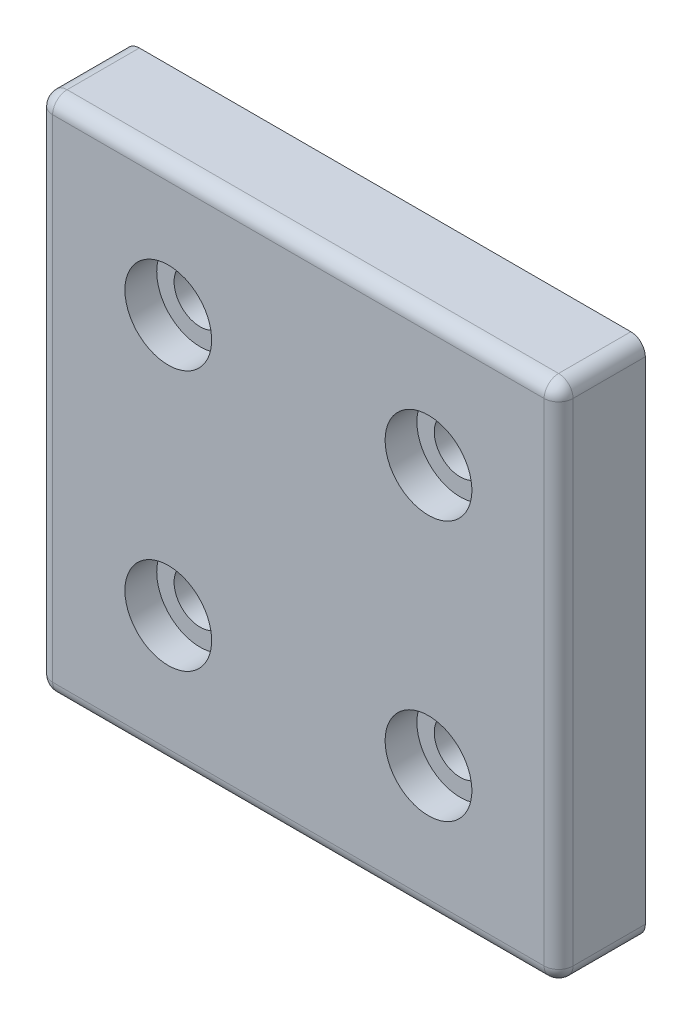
ISO-10303-21;
HEADER;
FILE_DESCRIPTION(('STEP AP214'),'2;1');
FILE_NAME('part.step','',(''),(''),'','','');
FILE_SCHEMA(('AUTOMOTIVE_DESIGN { 1 0 10303 214 1 1 1 1 }'));
ENDSEC;
DATA;
#1=APPLICATION_CONTEXT('core data for automotive mechanical design processes');
#2=APPLICATION_PROTOCOL_DEFINITION('international standard','automotive_design',2000,#1);
#3=PRODUCT_CONTEXT('',#1,'mechanical');
#4=PRODUCT('Part','Part','',(#3));
#5=PRODUCT_RELATED_PRODUCT_CATEGORY('part','',(#4));
#6=PRODUCT_DEFINITION_FORMATION('','',#4);
#7=PRODUCT_DEFINITION_CONTEXT('part definition',#1,'design');
#8=PRODUCT_DEFINITION('design','',#6,#7);
#9=PRODUCT_DEFINITION_SHAPE('','',#8);
#10=(LENGTH_UNIT() NAMED_UNIT(*) SI_UNIT(.MILLI.,.METRE.));
#11=(NAMED_UNIT(*) PLANE_ANGLE_UNIT() SI_UNIT($,.RADIAN.));
#12=(NAMED_UNIT(*) SI_UNIT($,.STERADIAN.) SOLID_ANGLE_UNIT());
#13=UNCERTAINTY_MEASURE_WITH_UNIT(LENGTH_MEASURE(1.E-05),#10,'distance_accuracy_value','');
#14=(GEOMETRIC_REPRESENTATION_CONTEXT(3) GLOBAL_UNCERTAINTY_ASSIGNED_CONTEXT((#13)) GLOBAL_UNIT_ASSIGNED_CONTEXT((#10,
#11,#12)) REPRESENTATION_CONTEXT('',''));
#15=CARTESIAN_POINT('',(0.,0.,0.));
#16=DIRECTION('',(0.,0.,1.));
#17=DIRECTION('',(1.,0.,0.));
#18=AXIS2_PLACEMENT_3D('',#15,#16,#17);
#19=CARTESIAN_POINT('',(0.,0.,15.));
#20=DIRECTION('',(0.,0.,1.));
#21=DIRECTION('',(1.,0.,0.));
#22=AXIS2_PLACEMENT_3D('',#19,#20,#21);
#23=PLANE('',#22);
#24=CARTESIAN_POINT('',(22.5,22.5,15.));
#25=DIRECTION('',(0.,0.,-1.));
#26=DIRECTION('',(-1.,0.,0.));
#27=AXIS2_PLACEMENT_3D('',#24,#25,#26);
#28=CIRCLE('',#27,7.5);
#29=CARTESIAN_POINT('',(15.,22.5,15.));
#30=VERTEX_POINT('',#29);
#31=EDGE_CURVE('E125',#30,#30,#28,.T.);
#32=ORIENTED_EDGE('',*,*,#31,.T.);
#33=EDGE_LOOP('',(#32));
#34=FACE_BOUND('',#33,.T.);
#35=CARTESIAN_POINT('',(-22.5,22.5,15.));
#36=DIRECTION('',(0.,0.,-1.));
#37=DIRECTION('',(-1.,0.,0.));
#38=AXIS2_PLACEMENT_3D('',#35,#36,#37);
#39=CIRCLE('',#38,7.5);
#40=CARTESIAN_POINT('',(-30.,22.5,15.));
#41=VERTEX_POINT('',#40);
#42=EDGE_CURVE('E19',#41,#41,#39,.T.);
#43=ORIENTED_EDGE('',*,*,#42,.T.);
#44=EDGE_LOOP('',(#43));
#45=FACE_BOUND('',#44,.T.);
#46=CARTESIAN_POINT('',(-22.5,-22.5,15.));
#47=DIRECTION('',(0.,0.,-1.));
#48=DIRECTION('',(-1.,0.,0.));
#49=AXIS2_PLACEMENT_3D('',#46,#47,#48);
#50=CIRCLE('',#49,7.5);
#51=CARTESIAN_POINT('',(-30.,-22.5,15.));
#52=VERTEX_POINT('',#51);
#53=EDGE_CURVE('E123',#52,#52,#50,.T.);
#54=ORIENTED_EDGE('',*,*,#53,.T.);
#55=EDGE_LOOP('',(#54));
#56=FACE_BOUND('',#55,.T.);
#57=CARTESIAN_POINT('',(22.5,-22.5,15.));
#58=DIRECTION('',(0.,0.,-1.));
#59=DIRECTION('',(-1.,0.,0.));
#60=AXIS2_PLACEMENT_3D('',#57,#58,#59);
#61=CIRCLE('',#60,7.5);
#62=CARTESIAN_POINT('',(15.,-22.5,15.));
#63=VERTEX_POINT('',#62);
#64=EDGE_CURVE('E119',#63,#63,#61,.T.);
#65=ORIENTED_EDGE('',*,*,#64,.T.);
#66=EDGE_LOOP('',(#65));
#67=FACE_BOUND('',#66,.T.);
#68=DIRECTION('',(-1.,0.,0.));
#69=VECTOR('',#68,1.);
#70=CARTESIAN_POINT('',(22.5,-42.5,15.));
#71=LINE('',#70,#69);
#72=CARTESIAN_POINT('',(42.5,-42.5,15.));
#73=VERTEX_POINT('',#72);
#74=CARTESIAN_POINT('',(-42.5,-42.5,15.));
#75=VERTEX_POINT('',#74);
#76=EDGE_CURVE('E346',#73,#75,#71,.T.);
#77=ORIENTED_EDGE('',*,*,#76,.F.);
#78=DIRECTION('',(0.,-1.,0.));
#79=VECTOR('',#78,1.);
#80=CARTESIAN_POINT('',(42.5,22.5,15.));
#81=LINE('',#80,#79);
#82=CARTESIAN_POINT('',(42.5,42.5,15.));
#83=VERTEX_POINT('',#82);
#84=EDGE_CURVE('E217',#83,#73,#81,.T.);
#85=ORIENTED_EDGE('',*,*,#84,.F.);
#86=DIRECTION('',(1.,0.,0.));
#87=VECTOR('',#86,1.);
#88=CARTESIAN_POINT('',(-22.5,42.5,15.));
#89=LINE('',#88,#87);
#90=CARTESIAN_POINT('',(-42.5,42.5,15.));
#91=VERTEX_POINT('',#90);
#92=EDGE_CURVE('E122',#91,#83,#89,.T.);
#93=ORIENTED_EDGE('',*,*,#92,.F.);
#94=DIRECTION('',(0.,1.,0.));
#95=VECTOR('',#94,1.);
#96=CARTESIAN_POINT('',(-42.5,-22.5,15.));
#97=LINE('',#96,#95);
#98=EDGE_CURVE('E260',#75,#91,#97,.T.);
#99=ORIENTED_EDGE('',*,*,#98,.F.);
#100=EDGE_LOOP('',(#77,#85,#93,#99));
#101=FACE_BOUND('',#100,.T.);
#102=ADVANCED_FACE('F15',(#34,#45,#56,#67,#101),#23,.T.);
#103=CARTESIAN_POINT('',(-22.5,22.5,15.));
#104=DIRECTION('',(0.,0.,-1.));
#105=DIRECTION('',(-1.,0.,0.));
#106=AXIS2_PLACEMENT_3D('',#103,#104,#105);
#107=CYLINDRICAL_SURFACE('',#106,7.5);
#108=CARTESIAN_POINT('',(-22.5,22.5,9.5));
#109=DIRECTION('',(0.,0.,-1.));
#110=DIRECTION('',(-1.,0.,0.));
#111=AXIS2_PLACEMENT_3D('',#108,#109,#110);
#112=CIRCLE('',#111,7.5);
#113=CARTESIAN_POINT('',(-30.,22.5,9.5));
#114=VERTEX_POINT('',#113);
#115=EDGE_CURVE('E115',#114,#114,#112,.T.);
#116=ORIENTED_EDGE('',*,*,#115,.T.);
#117=EDGE_LOOP('',(#116));
#118=FACE_BOUND('',#117,.T.);
#119=ORIENTED_EDGE('',*,*,#42,.F.);
#120=EDGE_LOOP('',(#119));
#121=FACE_BOUND('',#120,.T.);
#122=ADVANCED_FACE('F134',(#118,#121),#107,.F.);
#123=CARTESIAN_POINT('',(22.5,22.5,15.));
#124=DIRECTION('',(0.,0.,-1.));
#125=DIRECTION('',(-1.,0.,0.));
#126=AXIS2_PLACEMENT_3D('',#123,#124,#125);
#127=CYLINDRICAL_SURFACE('',#126,7.5);
#128=CARTESIAN_POINT('',(22.5,22.5,9.5));
#129=DIRECTION('',(0.,0.,-1.));
#130=DIRECTION('',(-1.,0.,0.));
#131=AXIS2_PLACEMENT_3D('',#128,#129,#130);
#132=CIRCLE('',#131,7.5);
#133=CARTESIAN_POINT('',(15.,22.5,9.5));
#134=VERTEX_POINT('',#133);
#135=EDGE_CURVE('E112',#134,#134,#132,.T.);
#136=ORIENTED_EDGE('',*,*,#135,.T.);
#137=EDGE_LOOP('',(#136));
#138=FACE_BOUND('',#137,.T.);
#139=ORIENTED_EDGE('',*,*,#31,.F.);
#140=EDGE_LOOP('',(#139));
#141=FACE_BOUND('',#140,.T.);
#142=ADVANCED_FACE('F136',(#138,#141),#127,.F.);
#143=CARTESIAN_POINT('',(-22.5,-22.5,15.));
#144=DIRECTION('',(0.,0.,-1.));
#145=DIRECTION('',(-1.,0.,0.));
#146=AXIS2_PLACEMENT_3D('',#143,#144,#145);
#147=CYLINDRICAL_SURFACE('',#146,7.5);
#148=CARTESIAN_POINT('',(-22.5,-22.5,9.5));
#149=DIRECTION('',(0.,0.,-1.));
#150=DIRECTION('',(-1.,0.,0.));
#151=AXIS2_PLACEMENT_3D('',#148,#149,#150);
#152=CIRCLE('',#151,7.5);
#153=CARTESIAN_POINT('',(-30.,-22.5,9.5));
#154=VERTEX_POINT('',#153);
#155=EDGE_CURVE('E109',#154,#154,#152,.T.);
#156=ORIENTED_EDGE('',*,*,#155,.T.);
#157=EDGE_LOOP('',(#156));
#158=FACE_BOUND('',#157,.T.);
#159=ORIENTED_EDGE('',*,*,#53,.F.);
#160=EDGE_LOOP('',(#159));
#161=FACE_BOUND('',#160,.T.);
#162=ADVANCED_FACE('F144',(#158,#161),#147,.F.);
#163=CARTESIAN_POINT('',(22.5,-22.5,15.));
#164=DIRECTION('',(0.,0.,-1.));
#165=DIRECTION('',(-1.,0.,0.));
#166=AXIS2_PLACEMENT_3D('',#163,#164,#165);
#167=CYLINDRICAL_SURFACE('',#166,7.5);
#168=CARTESIAN_POINT('',(22.5,-22.5,9.5));
#169=DIRECTION('',(0.,0.,-1.));
#170=DIRECTION('',(-1.,0.,0.));
#171=AXIS2_PLACEMENT_3D('',#168,#169,#170);
#172=CIRCLE('',#171,7.5);
#173=CARTESIAN_POINT('',(15.,-22.5,9.5));
#174=VERTEX_POINT('',#173);
#175=EDGE_CURVE('E105',#174,#174,#172,.T.);
#176=ORIENTED_EDGE('',*,*,#175,.T.);
#177=EDGE_LOOP('',(#176));
#178=FACE_BOUND('',#177,.T.);
#179=ORIENTED_EDGE('',*,*,#64,.F.);
#180=EDGE_LOOP('',(#179));
#181=FACE_BOUND('',#180,.T.);
#182=ADVANCED_FACE('F275',(#178,#181),#167,.F.);
#183=CARTESIAN_POINT('',(-22.5,42.5,12.5));
#184=DIRECTION('',(1.,0.,0.));
#185=DIRECTION('',(0.,1.,0.));
#186=AXIS2_PLACEMENT_3D('',#183,#184,#185);
#187=CYLINDRICAL_SURFACE('',#186,2.5);
#188=CARTESIAN_POINT('',(-42.5,42.5,12.5));
#189=DIRECTION('',(1.,0.,0.));
#190=DIRECTION('',(0.,1.,0.));
#191=AXIS2_PLACEMENT_3D('',#188,#189,#190);
#192=CIRCLE('',#191,2.5);
#193=CARTESIAN_POINT('',(-42.5,45.,12.5));
#194=VERTEX_POINT('',#193);
#195=EDGE_CURVE('E264',#91,#194,#192,.F.);
#196=ORIENTED_EDGE('',*,*,#195,.F.);
#197=ORIENTED_EDGE('',*,*,#92,.T.);
#198=CARTESIAN_POINT('',(42.5,42.5,12.5));
#199=DIRECTION('',(1.,0.,0.));
#200=DIRECTION('',(0.,1.,0.));
#201=AXIS2_PLACEMENT_3D('',#198,#199,#200);
#202=CIRCLE('',#201,2.5);
#203=CARTESIAN_POINT('',(42.5,45.,12.5));
#204=VERTEX_POINT('',#203);
#205=EDGE_CURVE('E214',#204,#83,#202,.T.);
#206=ORIENTED_EDGE('',*,*,#205,.F.);
#207=DIRECTION('',(1.,0.,0.));
#208=VECTOR('',#207,1.);
#209=CARTESIAN_POINT('',(-45.,45.,12.5));
#210=LINE('',#209,#208);
#211=EDGE_CURVE('E108',#194,#204,#210,.T.);
#212=ORIENTED_EDGE('',*,*,#211,.F.);
#213=EDGE_LOOP('',(#196,#197,#206,#212));
#214=FACE_BOUND('',#213,.T.);
#215=ADVANCED_FACE('F272',(#214),#187,.T.);
#216=CARTESIAN_POINT('',(-42.5,42.5,12.5));
#217=DIRECTION('',(1.,0.,0.));
#218=DIRECTION('',(0.,1.,0.));
#219=AXIS2_PLACEMENT_3D('',#216,#217,#218);
#220=SPHERICAL_SURFACE('',#219,2.5);
#221=ORIENTED_EDGE('',*,*,#195,.T.);
#222=CARTESIAN_POINT('',(-42.5,42.5,12.5));
#223=DIRECTION('',(0.,0.,1.));
#224=DIRECTION('',(1.,0.,0.));
#225=AXIS2_PLACEMENT_3D('',#222,#223,#224);
#226=CIRCLE('',#225,2.5);
#227=CARTESIAN_POINT('',(-45.,42.5,12.5));
#228=VERTEX_POINT('',#227);
#229=EDGE_CURVE('E220',#228,#194,#226,.F.);
#230=ORIENTED_EDGE('',*,*,#229,.F.);
#231=CARTESIAN_POINT('',(-42.5,42.5,12.5));
#232=DIRECTION('',(0.,1.,0.));
#233=DIRECTION('',(-1.,0.,0.));
#234=AXIS2_PLACEMENT_3D('',#231,#232,#233);
#235=CIRCLE('',#234,2.5);
#236=EDGE_CURVE('E261',#91,#228,#235,.F.);
#237=ORIENTED_EDGE('',*,*,#236,.F.);
#238=EDGE_LOOP('',(#221,#230,#237));
#239=FACE_BOUND('',#238,.T.);
#240=ADVANCED_FACE('F269',(#239),#220,.T.);
#241=CARTESIAN_POINT('',(-42.5,-22.5,12.5));
#242=DIRECTION('',(0.,1.,0.));
#243=DIRECTION('',(-1.,0.,0.));
#244=AXIS2_PLACEMENT_3D('',#241,#242,#243);
#245=CYLINDRICAL_SURFACE('',#244,2.5);
#246=CARTESIAN_POINT('',(-42.5,-42.5,12.5));
#247=DIRECTION('',(0.,-1.,0.));
#248=DIRECTION('',(1.,0.,0.));
#249=AXIS2_PLACEMENT_3D('',#246,#247,#248);
#250=CIRCLE('',#249,2.5);
#251=CARTESIAN_POINT('',(-45.,-42.5,12.5));
#252=VERTEX_POINT('',#251);
#253=EDGE_CURVE('E256',#75,#252,#250,.T.);
#254=ORIENTED_EDGE('',*,*,#253,.F.);
#255=ORIENTED_EDGE('',*,*,#98,.T.);
#256=ORIENTED_EDGE('',*,*,#236,.T.);
#257=DIRECTION('',(0.,1.,0.));
#258=VECTOR('',#257,1.);
#259=CARTESIAN_POINT('',(-45.,-45.,12.5));
#260=LINE('',#259,#258);
#261=EDGE_CURVE('E74',#252,#228,#260,.T.);
#262=ORIENTED_EDGE('',*,*,#261,.F.);
#263=EDGE_LOOP('',(#254,#255,#256,#262));
#264=FACE_BOUND('',#263,.T.);
#265=ADVANCED_FACE('F249',(#264),#245,.T.);
#266=CARTESIAN_POINT('',(-42.5,-42.5,12.5));
#267=DIRECTION('',(1.,0.,0.));
#268=DIRECTION('',(0.,1.,0.));
#269=AXIS2_PLACEMENT_3D('',#266,#267,#268);
#270=SPHERICAL_SURFACE('',#269,2.5);
#271=ORIENTED_EDGE('',*,*,#253,.T.);
#272=CARTESIAN_POINT('',(-42.5,-42.5,12.5));
#273=DIRECTION('',(0.,0.,1.));
#274=DIRECTION('',(1.,0.,0.));
#275=AXIS2_PLACEMENT_3D('',#272,#273,#274);
#276=CIRCLE('',#275,2.5);
#277=CARTESIAN_POINT('',(-42.5,-45.,12.5));
#278=VERTEX_POINT('',#277);
#279=EDGE_CURVE('E341',#278,#252,#276,.F.);
#280=ORIENTED_EDGE('',*,*,#279,.F.);
#281=CARTESIAN_POINT('',(-42.5,-42.5,12.5));
#282=DIRECTION('',(-1.,0.,0.));
#283=DIRECTION('',(0.,-1.,0.));
#284=AXIS2_PLACEMENT_3D('',#281,#282,#283);
#285=CIRCLE('',#284,2.5);
#286=EDGE_CURVE('E259',#75,#278,#285,.F.);
#287=ORIENTED_EDGE('',*,*,#286,.F.);
#288=EDGE_LOOP('',(#271,#280,#287));
#289=FACE_BOUND('',#288,.T.);
#290=ADVANCED_FACE('F244',(#289),#270,.T.);
#291=CARTESIAN_POINT('',(22.5,-42.5,12.5));
#292=DIRECTION('',(-1.,0.,0.));
#293=DIRECTION('',(0.,-1.,0.));
#294=AXIS2_PLACEMENT_3D('',#291,#292,#293);
#295=CYLINDRICAL_SURFACE('',#294,2.5);
#296=CARTESIAN_POINT('',(42.5,-42.5,12.5));
#297=DIRECTION('',(1.,0.,0.));
#298=DIRECTION('',(0.,1.,0.));
#299=AXIS2_PLACEMENT_3D('',#296,#297,#298);
#300=CIRCLE('',#299,2.5);
#301=CARTESIAN_POINT('',(42.5,-45.,12.5));
#302=VERTEX_POINT('',#301);
#303=EDGE_CURVE('E229',#73,#302,#300,.T.);
#304=ORIENTED_EDGE('',*,*,#303,.F.);
#305=ORIENTED_EDGE('',*,*,#76,.T.);
#306=ORIENTED_EDGE('',*,*,#286,.T.);
#307=DIRECTION('',(1.,0.,0.));
#308=VECTOR('',#307,1.);
#309=CARTESIAN_POINT('',(45.,-45.,12.5));
#310=LINE('',#309,#308);
#311=EDGE_CURVE('E230',#302,#278,#310,.F.);
#312=ORIENTED_EDGE('',*,*,#311,.F.);
#313=EDGE_LOOP('',(#304,#305,#306,#312));
#314=FACE_BOUND('',#313,.T.);
#315=ADVANCED_FACE('F240',(#314),#295,.T.);
#316=CARTESIAN_POINT('',(42.5,-42.5,12.5));
#317=DIRECTION('',(1.,0.,0.));
#318=DIRECTION('',(0.,1.,0.));
#319=AXIS2_PLACEMENT_3D('',#316,#317,#318);
#320=SPHERICAL_SURFACE('',#319,2.5);
#321=CARTESIAN_POINT('',(42.5,-42.5,12.5));
#322=DIRECTION('',(0.,-1.,0.));
#323=DIRECTION('',(0.,0.,-1.));
#324=AXIS2_PLACEMENT_3D('',#321,#322,#323);
#325=CIRCLE('',#324,2.5);
#326=CARTESIAN_POINT('',(45.,-42.5,12.5));
#327=VERTEX_POINT('',#326);
#328=EDGE_CURVE('E226',#73,#327,#325,.F.);
#329=ORIENTED_EDGE('',*,*,#328,.F.);
#330=ORIENTED_EDGE('',*,*,#303,.T.);
#331=CARTESIAN_POINT('',(42.5,-42.5,12.5));
#332=DIRECTION('',(0.,0.,1.));
#333=DIRECTION('',(1.,0.,0.));
#334=AXIS2_PLACEMENT_3D('',#331,#332,#333);
#335=CIRCLE('',#334,2.5);
#336=EDGE_CURVE('E221',#327,#302,#335,.F.);
#337=ORIENTED_EDGE('',*,*,#336,.F.);
#338=EDGE_LOOP('',(#329,#330,#337));
#339=FACE_BOUND('',#338,.T.);
#340=ADVANCED_FACE('F237',(#339),#320,.T.);
#341=CARTESIAN_POINT('',(42.5,22.5,12.5));
#342=DIRECTION('',(0.,-1.,0.));
#343=DIRECTION('',(0.,0.,-1.));
#344=AXIS2_PLACEMENT_3D('',#341,#342,#343);
#345=CYLINDRICAL_SURFACE('',#344,2.5);
#346=CARTESIAN_POINT('',(42.5,42.5,12.5));
#347=DIRECTION('',(0.,-1.,0.));
#348=DIRECTION('',(1.,0.,0.));
#349=AXIS2_PLACEMENT_3D('',#346,#347,#348);
#350=CIRCLE('',#349,2.5);
#351=CARTESIAN_POINT('',(45.,42.5,12.5));
#352=VERTEX_POINT('',#351);
#353=EDGE_CURVE('E118',#83,#352,#350,.F.);
#354=ORIENTED_EDGE('',*,*,#353,.F.);
#355=ORIENTED_EDGE('',*,*,#84,.T.);
#356=ORIENTED_EDGE('',*,*,#328,.T.);
#357=DIRECTION('',(0.,1.,0.));
#358=VECTOR('',#357,1.);
#359=CARTESIAN_POINT('',(45.,45.,12.5));
#360=LINE('',#359,#358);
#361=EDGE_CURVE('E329',#352,#327,#360,.F.);
#362=ORIENTED_EDGE('',*,*,#361,.F.);
#363=EDGE_LOOP('',(#354,#355,#356,#362));
#364=FACE_BOUND('',#363,.T.);
#365=ADVANCED_FACE('F204',(#364),#345,.T.);
#366=CARTESIAN_POINT('',(42.5,42.5,12.5));
#367=DIRECTION('',(1.,0.,0.));
#368=DIRECTION('',(0.,1.,0.));
#369=AXIS2_PLACEMENT_3D('',#366,#367,#368);
#370=SPHERICAL_SURFACE('',#369,2.5);
#371=ORIENTED_EDGE('',*,*,#205,.T.);
#372=ORIENTED_EDGE('',*,*,#353,.T.);
#373=CARTESIAN_POINT('',(42.5,42.5,12.5));
#374=DIRECTION('',(0.,0.,1.));
#375=DIRECTION('',(1.,0.,0.));
#376=AXIS2_PLACEMENT_3D('',#373,#374,#375);
#377=CIRCLE('',#376,2.5);
#378=EDGE_CURVE('E210',#204,#352,#377,.F.);
#379=ORIENTED_EDGE('',*,*,#378,.F.);
#380=EDGE_LOOP('',(#371,#372,#379));
#381=FACE_BOUND('',#380,.T.);
#382=ADVANCED_FACE('F199',(#381),#370,.T.);
#383=CARTESIAN_POINT('',(-30.15,30.15,9.5));
#384=DIRECTION('',(0.,0.,-1.));
#385=DIRECTION('',(1.,0.,0.));
#386=AXIS2_PLACEMENT_3D('',#383,#384,#385);
#387=PLANE('',#386);
#388=CARTESIAN_POINT('',(-22.5,22.5,9.5));
#389=DIRECTION('',(0.,0.,1.));
#390=DIRECTION('',(1.,0.,0.));
#391=AXIS2_PLACEMENT_3D('',#388,#389,#390);
#392=CIRCLE('',#391,4.5);
#393=CARTESIAN_POINT('',(-18.,22.5,9.5));
#394=VERTEX_POINT('',#393);
#395=EDGE_CURVE('E102',#394,#394,#392,.F.);
#396=ORIENTED_EDGE('',*,*,#395,.T.);
#397=EDGE_LOOP('',(#396));
#398=FACE_BOUND('',#397,.T.);
#399=ORIENTED_EDGE('',*,*,#115,.F.);
#400=EDGE_LOOP('',(#399));
#401=FACE_BOUND('',#400,.T.);
#402=ADVANCED_FACE('F203',(#398,#401),#387,.F.);
#403=CARTESIAN_POINT('',(14.85,30.15,9.5));
#404=DIRECTION('',(0.,0.,-1.));
#405=DIRECTION('',(1.,0.,0.));
#406=AXIS2_PLACEMENT_3D('',#403,#404,#405);
#407=PLANE('',#406);
#408=CARTESIAN_POINT('',(22.5,22.5,9.5));
#409=DIRECTION('',(0.,0.,1.));
#410=DIRECTION('',(1.,0.,0.));
#411=AXIS2_PLACEMENT_3D('',#408,#409,#410);
#412=CIRCLE('',#411,4.5);
#413=CARTESIAN_POINT('',(27.,22.5,9.5));
#414=VERTEX_POINT('',#413);
#415=EDGE_CURVE('E99',#414,#414,#412,.F.);
#416=ORIENTED_EDGE('',*,*,#415,.T.);
#417=EDGE_LOOP('',(#416));
#418=FACE_BOUND('',#417,.T.);
#419=ORIENTED_EDGE('',*,*,#135,.F.);
#420=EDGE_LOOP('',(#419));
#421=FACE_BOUND('',#420,.T.);
#422=ADVANCED_FACE('F378',(#418,#421),#407,.F.);
#423=CARTESIAN_POINT('',(-30.15,-14.85,9.5));
#424=DIRECTION('',(0.,0.,-1.));
#425=DIRECTION('',(1.,0.,0.));
#426=AXIS2_PLACEMENT_3D('',#423,#424,#425);
#427=PLANE('',#426);
#428=CARTESIAN_POINT('',(-22.5,-22.5,9.5));
#429=DIRECTION('',(0.,0.,1.));
#430=DIRECTION('',(1.,0.,0.));
#431=AXIS2_PLACEMENT_3D('',#428,#429,#430);
#432=CIRCLE('',#431,4.5);
#433=CARTESIAN_POINT('',(-18.,-22.5,9.5));
#434=VERTEX_POINT('',#433);
#435=EDGE_CURVE('E96',#434,#434,#432,.F.);
#436=ORIENTED_EDGE('',*,*,#435,.T.);
#437=EDGE_LOOP('',(#436));
#438=FACE_BOUND('',#437,.T.);
#439=ORIENTED_EDGE('',*,*,#155,.F.);
#440=EDGE_LOOP('',(#439));
#441=FACE_BOUND('',#440,.T.);
#442=ADVANCED_FACE('F384',(#438,#441),#427,.F.);
#443=CARTESIAN_POINT('',(14.85,-14.85,9.5));
#444=DIRECTION('',(0.,0.,-1.));
#445=DIRECTION('',(1.,0.,0.));
#446=AXIS2_PLACEMENT_3D('',#443,#444,#445);
#447=PLANE('',#446);
#448=CARTESIAN_POINT('',(22.5,-22.5,9.5));
#449=DIRECTION('',(0.,0.,1.));
#450=DIRECTION('',(1.,0.,0.));
#451=AXIS2_PLACEMENT_3D('',#448,#449,#450);
#452=CIRCLE('',#451,4.5);
#453=CARTESIAN_POINT('',(27.,-22.5,9.5));
#454=VERTEX_POINT('',#453);
#455=EDGE_CURVE('E89',#454,#454,#452,.F.);
#456=ORIENTED_EDGE('',*,*,#455,.T.);
#457=EDGE_LOOP('',(#456));
#458=FACE_BOUND('',#457,.T.);
#459=ORIENTED_EDGE('',*,*,#175,.F.);
#460=EDGE_LOOP('',(#459));
#461=FACE_BOUND('',#460,.T.);
#462=ADVANCED_FACE('F17',(#458,#461),#447,.F.);
#463=CARTESIAN_POINT('',(-45.,45.,0.));
#464=DIRECTION('',(0.,1.,0.));
#465=DIRECTION('',(0.,0.,1.));
#466=AXIS2_PLACEMENT_3D('',#463,#464,#465);
#467=PLANE('',#466);
#468=DIRECTION('',(0.,0.,1.));
#469=VECTOR('',#468,1.);
#470=CARTESIAN_POINT('',(-42.5,45.,0.));
#471=LINE('',#470,#469);
#472=CARTESIAN_POINT('',(-42.5,45.,0.));
#473=VERTEX_POINT('',#472);
#474=EDGE_CURVE('E60',#194,#473,#471,.F.);
#475=ORIENTED_EDGE('',*,*,#474,.F.);
#476=ORIENTED_EDGE('',*,*,#211,.T.);
#477=DIRECTION('',(0.,0.,1.));
#478=VECTOR('',#477,1.);
#479=CARTESIAN_POINT('',(42.5,45.,0.));
#480=LINE('',#479,#478);
#481=CARTESIAN_POINT('',(42.5,45.,0.));
#482=VERTEX_POINT('',#481);
#483=EDGE_CURVE('E327',#482,#204,#480,.T.);
#484=ORIENTED_EDGE('',*,*,#483,.F.);
#485=DIRECTION('',(1.,0.,0.));
#486=VECTOR('',#485,1.);
#487=CARTESIAN_POINT('',(0.,45.,0.));
#488=LINE('',#487,#486);
#489=EDGE_CURVE('E87',#482,#473,#488,.F.);
#490=ORIENTED_EDGE('',*,*,#489,.T.);
#491=EDGE_LOOP('',(#475,#476,#484,#490));
#492=FACE_BOUND('',#491,.T.);
#493=ADVANCED_FACE('F195',(#492),#467,.T.);
#494=CARTESIAN_POINT('',(-42.5,42.5,0.));
#495=DIRECTION('',(0.,0.,1.));
#496=DIRECTION('',(1.,0.,0.));
#497=AXIS2_PLACEMENT_3D('',#494,#495,#496);
#498=CYLINDRICAL_SURFACE('',#497,2.5);
#499=ORIENTED_EDGE('',*,*,#229,.T.);
#500=ORIENTED_EDGE('',*,*,#474,.T.);
#501=CARTESIAN_POINT('',(-42.5,42.5,0.));
#502=DIRECTION('',(0.,0.,1.));
#503=DIRECTION('',(1.,0.,0.));
#504=AXIS2_PLACEMENT_3D('',#501,#502,#503);
#505=CIRCLE('',#504,2.5);
#506=CARTESIAN_POINT('',(-45.,42.5,0.));
#507=VERTEX_POINT('',#506);
#508=EDGE_CURVE('E80',#473,#507,#505,.T.);
#509=ORIENTED_EDGE('',*,*,#508,.T.);
#510=DIRECTION('',(0.,0.,1.));
#511=VECTOR('',#510,1.);
#512=CARTESIAN_POINT('',(-45.,42.5,0.));
#513=LINE('',#512,#511);
#514=EDGE_CURVE('E67',#228,#507,#513,.F.);
#515=ORIENTED_EDGE('',*,*,#514,.F.);
#516=EDGE_LOOP('',(#499,#500,#509,#515));
#517=FACE_BOUND('',#516,.T.);
#518=ADVANCED_FACE('F86',(#517),#498,.T.);
#519=CARTESIAN_POINT('',(-45.,-45.,0.));
#520=DIRECTION('',(-1.,0.,0.));
#521=DIRECTION('',(0.,0.,1.));
#522=AXIS2_PLACEMENT_3D('',#519,#520,#521);
#523=PLANE('',#522);
#524=DIRECTION('',(0.,0.,1.));
#525=VECTOR('',#524,1.);
#526=CARTESIAN_POINT('',(-45.,-42.5,0.));
#527=LINE('',#526,#525);
#528=CARTESIAN_POINT('',(-45.,-42.5,0.));
#529=VERTEX_POINT('',#528);
#530=EDGE_CURVE('E233',#252,#529,#527,.F.);
#531=ORIENTED_EDGE('',*,*,#530,.F.);
#532=ORIENTED_EDGE('',*,*,#261,.T.);
#533=ORIENTED_EDGE('',*,*,#514,.T.);
#534=DIRECTION('',(0.,1.,0.));
#535=VECTOR('',#534,1.);
#536=CARTESIAN_POINT('',(-45.,0.,0.));
#537=LINE('',#536,#535);
#538=EDGE_CURVE('E71',#507,#529,#537,.F.);
#539=ORIENTED_EDGE('',*,*,#538,.T.);
#540=EDGE_LOOP('',(#531,#532,#533,#539));
#541=FACE_BOUND('',#540,.T.);
#542=ADVANCED_FACE('F70',(#541),#523,.T.);
#543=CARTESIAN_POINT('',(-42.5,-42.5,0.));
#544=DIRECTION('',(0.,0.,1.));
#545=DIRECTION('',(1.,0.,0.));
#546=AXIS2_PLACEMENT_3D('',#543,#544,#545);
#547=CYLINDRICAL_SURFACE('',#546,2.5);
#548=ORIENTED_EDGE('',*,*,#279,.T.);
#549=ORIENTED_EDGE('',*,*,#530,.T.);
#550=CARTESIAN_POINT('',(-42.5,-42.5,0.));
#551=DIRECTION('',(0.,0.,1.));
#552=DIRECTION('',(1.,0.,0.));
#553=AXIS2_PLACEMENT_3D('',#550,#551,#552);
#554=CIRCLE('',#553,2.5);
#555=CARTESIAN_POINT('',(-42.5,-45.,0.));
#556=VERTEX_POINT('',#555);
#557=EDGE_CURVE('E84',#529,#556,#554,.T.);
#558=ORIENTED_EDGE('',*,*,#557,.T.);
#559=DIRECTION('',(0.,0.,-1.));
#560=VECTOR('',#559,1.);
#561=CARTESIAN_POINT('',(-42.5,-45.,0.));
#562=LINE('',#561,#560);
#563=EDGE_CURVE('E225',#278,#556,#562,.T.);
#564=ORIENTED_EDGE('',*,*,#563,.F.);
#565=EDGE_LOOP('',(#548,#549,#558,#564));
#566=FACE_BOUND('',#565,.T.);
#567=ADVANCED_FACE('F186',(#566),#547,.T.);
#568=CARTESIAN_POINT('',(45.,-45.,0.));
#569=DIRECTION('',(0.,-1.,0.));
#570=DIRECTION('',(0.,0.,-1.));
#571=AXIS2_PLACEMENT_3D('',#568,#569,#570);
#572=PLANE('',#571);
#573=ORIENTED_EDGE('',*,*,#563,.T.);
#574=DIRECTION('',(1.,0.,0.));
#575=VECTOR('',#574,1.);
#576=CARTESIAN_POINT('',(0.,-45.,0.));
#577=LINE('',#576,#575);
#578=CARTESIAN_POINT('',(42.5,-45.,0.));
#579=VERTEX_POINT('',#578);
#580=EDGE_CURVE('E364',#556,#579,#577,.T.);
#581=ORIENTED_EDGE('',*,*,#580,.T.);
#582=DIRECTION('',(0.,0.,1.));
#583=VECTOR('',#582,1.);
#584=CARTESIAN_POINT('',(42.5,-45.,0.));
#585=LINE('',#584,#583);
#586=EDGE_CURVE('E224',#302,#579,#585,.F.);
#587=ORIENTED_EDGE('',*,*,#586,.F.);
#588=ORIENTED_EDGE('',*,*,#311,.T.);
#589=EDGE_LOOP('',(#573,#581,#587,#588));
#590=FACE_BOUND('',#589,.T.);
#591=ADVANCED_FACE('F182',(#590),#572,.T.);
#592=CARTESIAN_POINT('',(42.5,-42.5,0.));
#593=DIRECTION('',(0.,0.,1.));
#594=DIRECTION('',(1.,0.,0.));
#595=AXIS2_PLACEMENT_3D('',#592,#593,#594);
#596=CYLINDRICAL_SURFACE('',#595,2.5);
#597=ORIENTED_EDGE('',*,*,#336,.T.);
#598=ORIENTED_EDGE('',*,*,#586,.T.);
#599=CARTESIAN_POINT('',(42.5,-42.5,0.));
#600=DIRECTION('',(0.,0.,1.));
#601=DIRECTION('',(1.,0.,0.));
#602=AXIS2_PLACEMENT_3D('',#599,#600,#601);
#603=CIRCLE('',#602,2.5);
#604=CARTESIAN_POINT('',(45.,-42.5,0.));
#605=VERTEX_POINT('',#604);
#606=EDGE_CURVE('E362',#579,#605,#603,.T.);
#607=ORIENTED_EDGE('',*,*,#606,.T.);
#608=DIRECTION('',(0.,0.,-1.));
#609=VECTOR('',#608,1.);
#610=CARTESIAN_POINT('',(45.,-42.5,0.));
#611=LINE('',#610,#609);
#612=EDGE_CURVE('E332',#327,#605,#611,.T.);
#613=ORIENTED_EDGE('',*,*,#612,.F.);
#614=EDGE_LOOP('',(#597,#598,#607,#613));
#615=FACE_BOUND('',#614,.T.);
#616=ADVANCED_FACE('F178',(#615),#596,.T.);
#617=CARTESIAN_POINT('',(45.,45.,0.));
#618=DIRECTION('',(1.,0.,0.));
#619=DIRECTION('',(0.,0.,-1.));
#620=AXIS2_PLACEMENT_3D('',#617,#618,#619);
#621=PLANE('',#620);
#622=ORIENTED_EDGE('',*,*,#612,.T.);
#623=DIRECTION('',(0.,1.,0.));
#624=VECTOR('',#623,1.);
#625=CARTESIAN_POINT('',(45.,0.,0.));
#626=LINE('',#625,#624);
#627=CARTESIAN_POINT('',(45.,42.5,0.));
#628=VERTEX_POINT('',#627);
#629=EDGE_CURVE('E334',#605,#628,#626,.T.);
#630=ORIENTED_EDGE('',*,*,#629,.T.);
#631=DIRECTION('',(0.,0.,1.));
#632=VECTOR('',#631,1.);
#633=CARTESIAN_POINT('',(45.,42.5,0.));
#634=LINE('',#633,#632);
#635=EDGE_CURVE('E34',#352,#628,#634,.F.);
#636=ORIENTED_EDGE('',*,*,#635,.F.);
#637=ORIENTED_EDGE('',*,*,#361,.T.);
#638=EDGE_LOOP('',(#622,#630,#636,#637));
#639=FACE_BOUND('',#638,.T.);
#640=ADVANCED_FACE('F175',(#639),#621,.T.);
#641=CARTESIAN_POINT('',(42.5,42.5,0.));
#642=DIRECTION('',(0.,0.,1.));
#643=DIRECTION('',(1.,0.,0.));
#644=AXIS2_PLACEMENT_3D('',#641,#642,#643);
#645=CYLINDRICAL_SURFACE('',#644,2.5);
#646=ORIENTED_EDGE('',*,*,#378,.T.);
#647=ORIENTED_EDGE('',*,*,#635,.T.);
#648=CARTESIAN_POINT('',(42.5,42.5,0.));
#649=DIRECTION('',(0.,0.,1.));
#650=DIRECTION('',(1.,0.,0.));
#651=AXIS2_PLACEMENT_3D('',#648,#649,#650);
#652=CIRCLE('',#651,2.5);
#653=EDGE_CURVE('E361',#628,#482,#652,.T.);
#654=ORIENTED_EDGE('',*,*,#653,.T.);
#655=ORIENTED_EDGE('',*,*,#483,.T.);
#656=EDGE_LOOP('',(#646,#647,#654,#655));
#657=FACE_BOUND('',#656,.T.);
#658=ADVANCED_FACE('F171',(#657),#645,.T.);
#659=CARTESIAN_POINT('',(-22.5,22.5,0.));
#660=DIRECTION('',(0.,0.,1.));
#661=DIRECTION('',(1.,0.,0.));
#662=AXIS2_PLACEMENT_3D('',#659,#660,#661);
#663=CYLINDRICAL_SURFACE('',#662,4.5);
#664=CARTESIAN_POINT('',(-22.5,22.5,0.));
#665=DIRECTION('',(0.,0.,1.));
#666=DIRECTION('',(1.,0.,0.));
#667=AXIS2_PLACEMENT_3D('',#664,#665,#666);
#668=CIRCLE('',#667,4.5);
#669=CARTESIAN_POINT('',(-18.,22.5,0.));
#670=VERTEX_POINT('',#669);
#671=EDGE_CURVE('E358',#670,#670,#668,.F.);
#672=ORIENTED_EDGE('',*,*,#671,.T.);
#673=EDGE_LOOP('',(#672));
#674=FACE_BOUND('',#673,.T.);
#675=ORIENTED_EDGE('',*,*,#395,.F.);
#676=EDGE_LOOP('',(#675));
#677=FACE_BOUND('',#676,.T.);
#678=ADVANCED_FACE('F167',(#674,#677),#663,.F.);
#679=CARTESIAN_POINT('',(22.5,22.5,0.));
#680=DIRECTION('',(0.,0.,1.));
#681=DIRECTION('',(1.,0.,0.));
#682=AXIS2_PLACEMENT_3D('',#679,#680,#681);
#683=CYLINDRICAL_SURFACE('',#682,4.5);
#684=CARTESIAN_POINT('',(22.5,22.5,0.));
#685=DIRECTION('',(0.,0.,1.));
#686=DIRECTION('',(1.,0.,0.));
#687=AXIS2_PLACEMENT_3D('',#684,#685,#686);
#688=CIRCLE('',#687,4.5);
#689=CARTESIAN_POINT('',(27.,22.5,0.));
#690=VERTEX_POINT('',#689);
#691=EDGE_CURVE('E355',#690,#690,#688,.F.);
#692=ORIENTED_EDGE('',*,*,#691,.T.);
#693=EDGE_LOOP('',(#692));
#694=FACE_BOUND('',#693,.T.);
#695=ORIENTED_EDGE('',*,*,#415,.F.);
#696=EDGE_LOOP('',(#695));
#697=FACE_BOUND('',#696,.T.);
#698=ADVANCED_FACE('F163',(#694,#697),#683,.F.);
#699=CARTESIAN_POINT('',(-22.5,-22.5,0.));
#700=DIRECTION('',(0.,0.,1.));
#701=DIRECTION('',(1.,0.,0.));
#702=AXIS2_PLACEMENT_3D('',#699,#700,#701);
#703=CYLINDRICAL_SURFACE('',#702,4.5);
#704=CARTESIAN_POINT('',(-22.5,-22.5,0.));
#705=DIRECTION('',(0.,0.,1.));
#706=DIRECTION('',(1.,0.,0.));
#707=AXIS2_PLACEMENT_3D('',#704,#705,#706);
#708=CIRCLE('',#707,4.5);
#709=CARTESIAN_POINT('',(-18.,-22.5,0.));
#710=VERTEX_POINT('',#709);
#711=EDGE_CURVE('E25',#710,#710,#708,.F.);
#712=ORIENTED_EDGE('',*,*,#711,.T.);
#713=EDGE_LOOP('',(#712));
#714=FACE_BOUND('',#713,.T.);
#715=ORIENTED_EDGE('',*,*,#435,.F.);
#716=EDGE_LOOP('',(#715));
#717=FACE_BOUND('',#716,.T.);
#718=ADVANCED_FACE('F155',(#714,#717),#703,.F.);
#719=CARTESIAN_POINT('',(22.5,-22.5,0.));
#720=DIRECTION('',(0.,0.,1.));
#721=DIRECTION('',(1.,0.,0.));
#722=AXIS2_PLACEMENT_3D('',#719,#720,#721);
#723=CYLINDRICAL_SURFACE('',#722,4.5);
#724=CARTESIAN_POINT('',(22.5,-22.5,0.));
#725=DIRECTION('',(0.,0.,1.));
#726=DIRECTION('',(1.,0.,0.));
#727=AXIS2_PLACEMENT_3D('',#724,#725,#726);
#728=CIRCLE('',#727,4.5);
#729=CARTESIAN_POINT('',(27.,-22.5,0.));
#730=VERTEX_POINT('',#729);
#731=EDGE_CURVE('E10',#730,#730,#728,.F.);
#732=ORIENTED_EDGE('',*,*,#731,.T.);
#733=EDGE_LOOP('',(#732));
#734=FACE_BOUND('',#733,.T.);
#735=ORIENTED_EDGE('',*,*,#455,.F.);
#736=EDGE_LOOP('',(#735));
#737=FACE_BOUND('',#736,.T.);
#738=ADVANCED_FACE('F149',(#734,#737),#723,.F.);
#739=CARTESIAN_POINT('',(0.,0.,0.));
#740=DIRECTION('',(0.,0.,1.));
#741=DIRECTION('',(1.,0.,0.));
#742=AXIS2_PLACEMENT_3D('',#739,#740,#741);
#743=PLANE('',#742);
#744=ORIENTED_EDGE('',*,*,#731,.F.);
#745=EDGE_LOOP('',(#744));
#746=FACE_BOUND('',#745,.T.);
#747=ORIENTED_EDGE('',*,*,#711,.F.);
#748=EDGE_LOOP('',(#747));
#749=FACE_BOUND('',#748,.T.);
#750=ORIENTED_EDGE('',*,*,#691,.F.);
#751=EDGE_LOOP('',(#750));
#752=FACE_BOUND('',#751,.T.);
#753=ORIENTED_EDGE('',*,*,#671,.F.);
#754=EDGE_LOOP('',(#753));
#755=FACE_BOUND('',#754,.T.);
#756=ORIENTED_EDGE('',*,*,#629,.F.);
#757=ORIENTED_EDGE('',*,*,#606,.F.);
#758=ORIENTED_EDGE('',*,*,#580,.F.);
#759=ORIENTED_EDGE('',*,*,#557,.F.);
#760=ORIENTED_EDGE('',*,*,#538,.F.);
#761=ORIENTED_EDGE('',*,*,#508,.F.);
#762=ORIENTED_EDGE('',*,*,#489,.F.);
#763=ORIENTED_EDGE('',*,*,#653,.F.);
#764=EDGE_LOOP('',(#756,#757,#758,#759,#760,#761,#762,#763));
#765=FACE_BOUND('',#764,.T.);
#766=ADVANCED_FACE('F79',(#746,#749,#752,#755,#765),#743,.F.);
#767=CLOSED_SHELL('',(#102,#122,#142,#162,#182,#215,#240,#265,#290,#315,#340,#365,#382,#402,
#422,#442,#462,#493,#518,#542,#567,#591,#616,#640,#658,#678,#698,#718,#738,#766));
#768=MANIFOLD_SOLID_BREP('B1',#767);
#769=ADVANCED_BREP_SHAPE_REPRESENTATION('',(#18,#768),#14);
#770=SHAPE_DEFINITION_REPRESENTATION(#9,#769);
ENDSEC;
END-ISO-10303-21;
